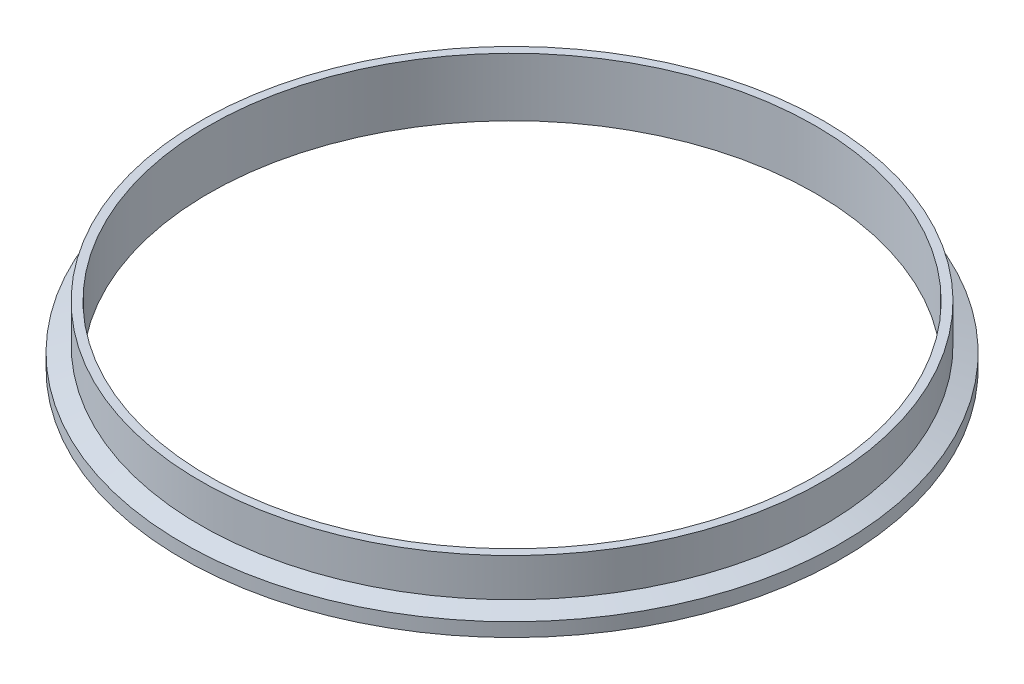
ISO-10303-21;
HEADER;
FILE_DESCRIPTION(('STEP AP214'),'2;1');
FILE_NAME('part.step','',(''),(''),'','','');
FILE_SCHEMA(('AUTOMOTIVE_DESIGN { 1 0 10303 214 1 1 1 1 }'));
ENDSEC;
DATA;
#1=APPLICATION_CONTEXT('core data for automotive mechanical design processes');
#2=APPLICATION_PROTOCOL_DEFINITION('international standard','automotive_design',2000,#1);
#3=PRODUCT_CONTEXT('',#1,'mechanical');
#4=PRODUCT('Part','Part','',(#3));
#5=PRODUCT_RELATED_PRODUCT_CATEGORY('part','',(#4));
#6=PRODUCT_DEFINITION_FORMATION('','',#4);
#7=PRODUCT_DEFINITION_CONTEXT('part definition',#1,'design');
#8=PRODUCT_DEFINITION('design','',#6,#7);
#9=PRODUCT_DEFINITION_SHAPE('','',#8);
#10=(LENGTH_UNIT() NAMED_UNIT(*) SI_UNIT(.MILLI.,.METRE.));
#11=(NAMED_UNIT(*) PLANE_ANGLE_UNIT() SI_UNIT($,.RADIAN.));
#12=(NAMED_UNIT(*) SI_UNIT($,.STERADIAN.) SOLID_ANGLE_UNIT());
#13=UNCERTAINTY_MEASURE_WITH_UNIT(LENGTH_MEASURE(1.E-05),#10,'distance_accuracy_value','');
#14=(GEOMETRIC_REPRESENTATION_CONTEXT(3) GLOBAL_UNCERTAINTY_ASSIGNED_CONTEXT((#13)) GLOBAL_UNIT_ASSIGNED_CONTEXT((#10,
#11,#12)) REPRESENTATION_CONTEXT('',''));
#15=CARTESIAN_POINT('',(0.,0.,0.));
#16=DIRECTION('',(0.,0.,1.));
#17=DIRECTION('',(1.,0.,0.));
#18=AXIS2_PLACEMENT_3D('',#15,#16,#17);
#19=CARTESIAN_POINT('',(0.,0.787399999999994,0.));
#20=DIRECTION('',(0.,-1.,0.));
#21=DIRECTION('',(0.,0.,-1.));
#22=AXIS2_PLACEMENT_3D('',#19,#20,#21);
#23=TOROIDAL_SURFACE('',#22,130.799208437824,0.787400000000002);
#24=CARTESIAN_POINT('',(0.,0.,0.));
#25=DIRECTION('',(0.,-1.,0.));
#26=DIRECTION('',(0.,0.,-1.));
#27=AXIS2_PLACEMENT_3D('',#24,#25,#26);
#28=CIRCLE('',#27,130.799208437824);
#29=CARTESIAN_POINT('',(0.,0.,-130.799208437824));
#30=VERTEX_POINT('',#29);
#31=EDGE_CURVE('E74',#30,#30,#28,.T.);
#32=ORIENTED_EDGE('',*,*,#31,.T.);
#33=EDGE_LOOP('',(#32));
#34=FACE_BOUND('',#33,.T.);
#35=CARTESIAN_POINT('',(0.,0.474458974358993,0.));
#36=DIRECTION('',(0.,-1.,0.));
#37=DIRECTION('',(0.,0.,-1.));
#38=AXIS2_PLACEMENT_3D('',#35,#36,#37);
#39=CIRCLE('',#38,130.076666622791);
#40=CARTESIAN_POINT('',(0.,0.474458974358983,-130.076666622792));
#41=VERTEX_POINT('',#40);
#42=EDGE_CURVE('E12',#41,#41,#39,.T.);
#43=ORIENTED_EDGE('',*,*,#42,.F.);
#44=EDGE_LOOP('',(#43));
#45=FACE_BOUND('',#44,.T.);
#46=ADVANCED_FACE('F40',(#34,#45),#23,.T.);
#47=CARTESIAN_POINT('',(0.,0.,0.));
#48=DIRECTION('',(0.,-1.,0.));
#49=DIRECTION('',(0.,0.,-1.));
#50=AXIS2_PLACEMENT_3D('',#47,#48,#49);
#51=TOROIDAL_SURFACE('',#50,128.9812,1.1938);
#52=CARTESIAN_POINT('',(0.,0.474458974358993,0.));
#53=DIRECTION('',(0.,-1.,0.));
#54=DIRECTION('',(0.,0.,-1.));
#55=AXIS2_PLACEMENT_3D('',#52,#53,#54);
#56=CIRCLE('',#55,127.885733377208);
#57=CARTESIAN_POINT('',(0.,0.474458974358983,-127.885733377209));
#58=VERTEX_POINT('',#57);
#59=EDGE_CURVE('E46',#58,#58,#56,.T.);
#60=ORIENTED_EDGE('',*,*,#59,.F.);
#61=EDGE_LOOP('',(#60));
#62=FACE_BOUND('',#61,.T.);
#63=ORIENTED_EDGE('',*,*,#42,.T.);
#64=EDGE_LOOP('',(#63));
#65=FACE_BOUND('',#64,.T.);
#66=ADVANCED_FACE('F122',(#62,#65),#51,.F.);
#67=CARTESIAN_POINT('',(0.,0.787399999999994,0.));
#68=DIRECTION('',(0.,-1.,0.));
#69=DIRECTION('',(0.,0.,-1.));
#70=AXIS2_PLACEMENT_3D('',#67,#68,#69);
#71=TOROIDAL_SURFACE('',#70,127.163191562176,0.787400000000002);
#72=ORIENTED_EDGE('',*,*,#59,.T.);
#73=EDGE_LOOP('',(#72));
#74=FACE_BOUND('',#73,.T.);
#75=CARTESIAN_POINT('',(0.,0.,0.));
#76=DIRECTION('',(0.,-1.,0.));
#77=DIRECTION('',(0.,0.,-1.));
#78=AXIS2_PLACEMENT_3D('',#75,#76,#77);
#79=CIRCLE('',#78,127.163191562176);
#80=CARTESIAN_POINT('',(0.,0.,-127.163191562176));
#81=VERTEX_POINT('',#80);
#82=EDGE_CURVE('E50',#81,#81,#79,.T.);
#83=ORIENTED_EDGE('',*,*,#82,.F.);
#84=EDGE_LOOP('',(#83));
#85=FACE_BOUND('',#84,.T.);
#86=ADVANCED_FACE('F118',(#74,#85),#71,.T.);
#87=CARTESIAN_POINT('',(0.,0.,0.));
#88=DIRECTION('',(0.,1.,0.));
#89=DIRECTION('',(0.,0.,1.));
#90=AXIS2_PLACEMENT_3D('',#87,#88,#89);
#91=PLANE('',#90);
#92=CARTESIAN_POINT('',(0.,0.,0.));
#93=DIRECTION('',(0.,-1.,0.));
#94=DIRECTION('',(0.,0.,-1.));
#95=AXIS2_PLACEMENT_3D('',#92,#93,#94);
#96=CIRCLE('',#95,123.5964);
#97=CARTESIAN_POINT('',(0.,0.,-123.5964));
#98=VERTEX_POINT('',#97);
#99=EDGE_CURVE('E54',#98,#98,#96,.T.);
#100=ORIENTED_EDGE('',*,*,#99,.F.);
#101=EDGE_LOOP('',(#100));
#102=FACE_BOUND('',#101,.T.);
#103=ORIENTED_EDGE('',*,*,#82,.T.);
#104=EDGE_LOOP('',(#103));
#105=FACE_BOUND('',#104,.T.);
#106=ADVANCED_FACE('F112',(#102,#105),#91,.F.);
#107=CARTESIAN_POINT('',(0.,0.,0.));
#108=DIRECTION('',(0.,-1.,0.));
#109=DIRECTION('',(0.,0.,-1.));
#110=AXIS2_PLACEMENT_3D('',#107,#108,#109);
#111=CYLINDRICAL_SURFACE('',#110,123.5964);
#112=ORIENTED_EDGE('',*,*,#99,.T.);
#113=EDGE_LOOP('',(#112));
#114=FACE_BOUND('',#113,.T.);
#115=CARTESIAN_POINT('',(0.,23.8125,0.));
#116=DIRECTION('',(0.,-1.,0.));
#117=DIRECTION('',(0.,0.,-1.));
#118=AXIS2_PLACEMENT_3D('',#115,#116,#117);
#119=CIRCLE('',#118,123.5964);
#120=CARTESIAN_POINT('',(0.,23.8125,-123.5964));
#121=VERTEX_POINT('',#120);
#122=EDGE_CURVE('E59',#121,#121,#119,.T.);
#123=ORIENTED_EDGE('',*,*,#122,.F.);
#124=EDGE_LOOP('',(#123));
#125=FACE_BOUND('',#124,.T.);
#126=ADVANCED_FACE('F107',(#114,#125),#111,.F.);
#127=CARTESIAN_POINT('',(0.,23.8125,0.));
#128=DIRECTION('',(0.,-1.,0.));
#129=DIRECTION('',(0.,0.,-1.));
#130=AXIS2_PLACEMENT_3D('',#127,#128,#129);
#131=PLANE('',#130);
#132=CARTESIAN_POINT('',(0.,23.8125,0.));
#133=DIRECTION('',(0.,-1.,0.));
#134=DIRECTION('',(0.,0.,-1.));
#135=AXIS2_PLACEMENT_3D('',#132,#133,#134);
#136=CIRCLE('',#135,127.);
#137=CARTESIAN_POINT('',(0.,23.8125,-127.));
#138=VERTEX_POINT('',#137);
#139=EDGE_CURVE('E62',#138,#138,#136,.T.);
#140=ORIENTED_EDGE('',*,*,#139,.F.);
#141=EDGE_LOOP('',(#140));
#142=FACE_BOUND('',#141,.T.);
#143=ORIENTED_EDGE('',*,*,#122,.T.);
#144=EDGE_LOOP('',(#143));
#145=FACE_BOUND('',#144,.T.);
#146=ADVANCED_FACE('F101',(#142,#145),#131,.F.);
#147=CARTESIAN_POINT('',(0.,0.,0.));
#148=DIRECTION('',(0.,-1.,0.));
#149=DIRECTION('',(0.,0.,-1.));
#150=AXIS2_PLACEMENT_3D('',#147,#148,#149);
#151=CYLINDRICAL_SURFACE('',#150,127.);
#152=CARTESIAN_POINT('',(0.,8.22278052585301,0.));
#153=DIRECTION('',(0.,-1.,0.));
#154=DIRECTION('',(0.,0.,-1.));
#155=AXIS2_PLACEMENT_3D('',#152,#153,#154);
#156=CIRCLE('',#155,127.);
#157=CARTESIAN_POINT('',(0.,8.222780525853,-127.));
#158=VERTEX_POINT('',#157);
#159=EDGE_CURVE('E65',#158,#158,#156,.T.);
#160=ORIENTED_EDGE('',*,*,#159,.F.);
#161=EDGE_LOOP('',(#160));
#162=FACE_BOUND('',#161,.T.);
#163=ORIENTED_EDGE('',*,*,#139,.T.);
#164=EDGE_LOOP('',(#163));
#165=FACE_BOUND('',#164,.T.);
#166=ADVANCED_FACE('F95',(#162,#165),#151,.T.);
#167=CARTESIAN_POINT('',(0.,8.22278052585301,0.));
#168=DIRECTION('',(0.,-1.,0.));
#169=DIRECTION('',(0.,0.,-1.));
#170=AXIS2_PLACEMENT_3D('',#167,#168,#169);
#171=CONICAL_SURFACE('',#170,127.,1.22173047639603);
#172=CARTESIAN_POINT('',(0.,5.58799999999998,0.));
#173=DIRECTION('',(0.,-1.,0.));
#174=DIRECTION('',(0.,0.,-1.));
#175=AXIS2_PLACEMENT_3D('',#172,#173,#174);
#176=CIRCLE('',#175,134.239);
#177=CARTESIAN_POINT('',(0.,5.58799999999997,-134.239));
#178=VERTEX_POINT('',#177);
#179=EDGE_CURVE('E68',#178,#178,#176,.T.);
#180=ORIENTED_EDGE('',*,*,#179,.F.);
#181=EDGE_LOOP('',(#180));
#182=FACE_BOUND('',#181,.T.);
#183=ORIENTED_EDGE('',*,*,#159,.T.);
#184=EDGE_LOOP('',(#183));
#185=FACE_BOUND('',#184,.T.);
#186=ADVANCED_FACE('F89',(#182,#185),#171,.T.);
#187=CARTESIAN_POINT('',(0.,0.,0.));
#188=DIRECTION('',(0.,-1.,0.));
#189=DIRECTION('',(0.,0.,-1.));
#190=AXIS2_PLACEMENT_3D('',#187,#188,#189);
#191=CYLINDRICAL_SURFACE('',#190,134.239);
#192=CARTESIAN_POINT('',(0.,0.,0.));
#193=DIRECTION('',(0.,-1.,0.));
#194=DIRECTION('',(0.,0.,-1.));
#195=AXIS2_PLACEMENT_3D('',#192,#193,#194);
#196=CIRCLE('',#195,134.239);
#197=CARTESIAN_POINT('',(0.,0.,-134.239));
#198=VERTEX_POINT('',#197);
#199=EDGE_CURVE('E71',#198,#198,#196,.T.);
#200=ORIENTED_EDGE('',*,*,#199,.F.);
#201=EDGE_LOOP('',(#200));
#202=FACE_BOUND('',#201,.T.);
#203=ORIENTED_EDGE('',*,*,#179,.T.);
#204=EDGE_LOOP('',(#203));
#205=FACE_BOUND('',#204,.T.);
#206=ADVANCED_FACE('F83',(#202,#205),#191,.T.);
#207=CARTESIAN_POINT('',(0.,0.,0.));
#208=DIRECTION('',(0.,1.,0.));
#209=DIRECTION('',(0.,0.,1.));
#210=AXIS2_PLACEMENT_3D('',#207,#208,#209);
#211=PLANE('',#210);
#212=ORIENTED_EDGE('',*,*,#31,.F.);
#213=EDGE_LOOP('',(#212));
#214=FACE_BOUND('',#213,.T.);
#215=ORIENTED_EDGE('',*,*,#199,.T.);
#216=EDGE_LOOP('',(#215));
#217=FACE_BOUND('',#216,.T.);
#218=ADVANCED_FACE('F80',(#214,#217),#211,.F.);
#219=CLOSED_SHELL('',(#46,#66,#86,#106,#126,#146,#166,#186,#206,#218));
#220=MANIFOLD_SOLID_BREP('B2',#219);
#221=ADVANCED_BREP_SHAPE_REPRESENTATION('',(#18,#220),#14);
#222=SHAPE_DEFINITION_REPRESENTATION(#9,#221);
ENDSEC;
END-ISO-10303-21;
